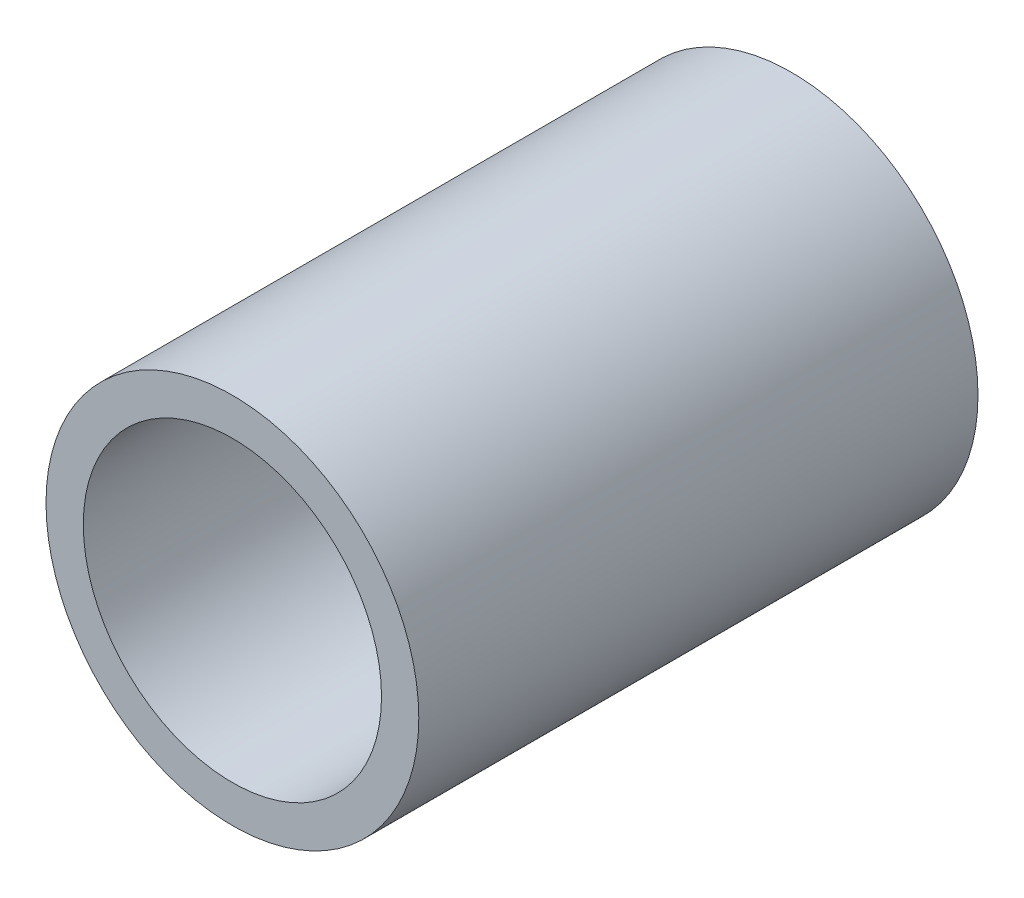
ISO-10303-21;
HEADER;
FILE_DESCRIPTION(('STEP AP214'),'2;1');
FILE_NAME('part.step','',(''),(''),'','','');
FILE_SCHEMA(('AUTOMOTIVE_DESIGN { 1 0 10303 214 1 1 1 1 }'));
ENDSEC;
DATA;
#1=APPLICATION_CONTEXT('core data for automotive mechanical design processes');
#2=APPLICATION_PROTOCOL_DEFINITION('international standard','automotive_design',2000,#1);
#3=PRODUCT_CONTEXT('',#1,'mechanical');
#4=PRODUCT('Part','Part','',(#3));
#5=PRODUCT_RELATED_PRODUCT_CATEGORY('part','',(#4));
#6=PRODUCT_DEFINITION_FORMATION('','',#4);
#7=PRODUCT_DEFINITION_CONTEXT('part definition',#1,'design');
#8=PRODUCT_DEFINITION('design','',#6,#7);
#9=PRODUCT_DEFINITION_SHAPE('','',#8);
#10=(LENGTH_UNIT() NAMED_UNIT(*) SI_UNIT(.MILLI.,.METRE.));
#11=(NAMED_UNIT(*) PLANE_ANGLE_UNIT() SI_UNIT($,.RADIAN.));
#12=(NAMED_UNIT(*) SI_UNIT($,.STERADIAN.) SOLID_ANGLE_UNIT());
#13=UNCERTAINTY_MEASURE_WITH_UNIT(LENGTH_MEASURE(1.E-05),#10,'distance_accuracy_value','');
#14=(GEOMETRIC_REPRESENTATION_CONTEXT(3) GLOBAL_UNCERTAINTY_ASSIGNED_CONTEXT((#13)) GLOBAL_UNIT_ASSIGNED_CONTEXT((#10,
#11,#12)) REPRESENTATION_CONTEXT('',''));
#15=CARTESIAN_POINT('',(0.,0.,0.));
#16=DIRECTION('',(0.,0.,1.));
#17=DIRECTION('',(1.,0.,0.));
#18=AXIS2_PLACEMENT_3D('',#15,#16,#17);
#19=CARTESIAN_POINT('',(0.,0.,150.));
#20=DIRECTION('',(0.,0.,1.));
#21=DIRECTION('',(1.,0.,0.));
#22=AXIS2_PLACEMENT_3D('',#19,#20,#21);
#23=PLANE('',#22);
#24=CARTESIAN_POINT('',(0.,0.,150.));
#25=DIRECTION('',(0.,0.,1.));
#26=DIRECTION('',(1.,0.,0.));
#27=AXIS2_PLACEMENT_3D('',#24,#25,#26);
#28=CIRCLE('',#27,50.);
#29=CARTESIAN_POINT('',(50.,0.,150.));
#30=VERTEX_POINT('',#29);
#31=EDGE_CURVE('E10',#30,#30,#28,.T.);
#32=ORIENTED_EDGE('',*,*,#31,.T.);
#33=EDGE_LOOP('',(#32));
#34=FACE_BOUND('',#33,.T.);
#35=CARTESIAN_POINT('',(0.,0.,150.));
#36=DIRECTION('',(0.,0.,1.));
#37=DIRECTION('',(1.,0.,0.));
#38=AXIS2_PLACEMENT_3D('',#35,#36,#37);
#39=CIRCLE('',#38,40.);
#40=CARTESIAN_POINT('',(40.,0.,150.));
#41=VERTEX_POINT('',#40);
#42=EDGE_CURVE('E46',#41,#41,#39,.T.);
#43=ORIENTED_EDGE('',*,*,#42,.F.);
#44=EDGE_LOOP('',(#43));
#45=FACE_BOUND('',#44,.T.);
#46=ADVANCED_FACE('F35',(#34,#45),#23,.T.);
#47=CARTESIAN_POINT('',(0.,0.,0.));
#48=DIRECTION('',(0.,0.,1.));
#49=DIRECTION('',(1.,0.,0.));
#50=AXIS2_PLACEMENT_3D('',#47,#48,#49);
#51=PLANE('',#50);
#52=CARTESIAN_POINT('',(0.,0.,0.));
#53=DIRECTION('',(0.,0.,1.));
#54=DIRECTION('',(1.,0.,0.));
#55=AXIS2_PLACEMENT_3D('',#52,#53,#54);
#56=CIRCLE('',#55,50.);
#57=CARTESIAN_POINT('',(50.,0.,0.));
#58=VERTEX_POINT('',#57);
#59=EDGE_CURVE('E39',#58,#58,#56,.T.);
#60=ORIENTED_EDGE('',*,*,#59,.F.);
#61=EDGE_LOOP('',(#60));
#62=FACE_BOUND('',#61,.T.);
#63=CARTESIAN_POINT('',(0.,0.,0.));
#64=DIRECTION('',(0.,0.,1.));
#65=DIRECTION('',(1.,0.,0.));
#66=AXIS2_PLACEMENT_3D('',#63,#64,#65);
#67=CIRCLE('',#66,40.);
#68=CARTESIAN_POINT('',(40.,0.,0.));
#69=VERTEX_POINT('',#68);
#70=EDGE_CURVE('E48',#69,#69,#67,.T.);
#71=ORIENTED_EDGE('',*,*,#70,.T.);
#72=EDGE_LOOP('',(#71));
#73=FACE_BOUND('',#72,.T.);
#74=ADVANCED_FACE('F58',(#62,#73),#51,.F.);
#75=CARTESIAN_POINT('',(0.,0.,150.));
#76=DIRECTION('',(0.,0.,-1.));
#77=DIRECTION('',(-1.,0.,0.));
#78=AXIS2_PLACEMENT_3D('',#75,#76,#77);
#79=CYLINDRICAL_SURFACE('',#78,50.);
#80=ORIENTED_EDGE('',*,*,#31,.F.);
#81=EDGE_LOOP('',(#80));
#82=FACE_BOUND('',#81,.T.);
#83=ORIENTED_EDGE('',*,*,#59,.T.);
#84=EDGE_LOOP('',(#83));
#85=FACE_BOUND('',#84,.T.);
#86=ADVANCED_FACE('F37',(#82,#85),#79,.T.);
#87=CARTESIAN_POINT('',(0.,0.,150.));
#88=DIRECTION('',(0.,0.,-1.));
#89=DIRECTION('',(-1.,0.,0.));
#90=AXIS2_PLACEMENT_3D('',#87,#88,#89);
#91=CYLINDRICAL_SURFACE('',#90,40.);
#92=ORIENTED_EDGE('',*,*,#42,.T.);
#93=EDGE_LOOP('',(#92));
#94=FACE_BOUND('',#93,.T.);
#95=ORIENTED_EDGE('',*,*,#70,.F.);
#96=EDGE_LOOP('',(#95));
#97=FACE_BOUND('',#96,.T.);
#98=ADVANCED_FACE('F54',(#94,#97),#91,.F.);
#99=CLOSED_SHELL('',(#46,#74,#86,#98));
#100=MANIFOLD_SOLID_BREP('B2',#99);
#101=ADVANCED_BREP_SHAPE_REPRESENTATION('',(#18,#100),#14);
#102=SHAPE_DEFINITION_REPRESENTATION(#9,#101);
ENDSEC;
END-ISO-10303-21;
